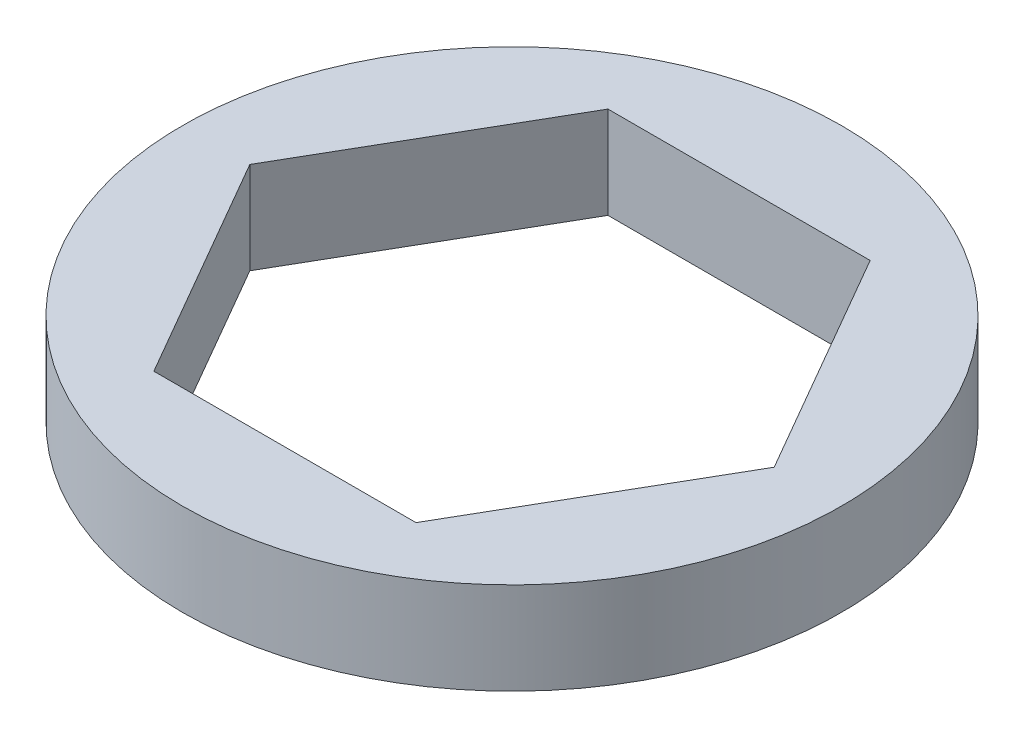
ISO-10303-21;
HEADER;
FILE_DESCRIPTION(('STEP AP214'),'2;1');
FILE_NAME('part.step','',(''),(''),'','','');
FILE_SCHEMA(('AUTOMOTIVE_DESIGN { 1 0 10303 214 1 1 1 1 }'));
ENDSEC;
DATA;
#1=APPLICATION_CONTEXT('core data for automotive mechanical design processes');
#2=APPLICATION_PROTOCOL_DEFINITION('international standard','automotive_design',2000,#1);
#3=PRODUCT_CONTEXT('',#1,'mechanical');
#4=PRODUCT('Part','Part','',(#3));
#5=PRODUCT_RELATED_PRODUCT_CATEGORY('part','',(#4));
#6=PRODUCT_DEFINITION_FORMATION('','',#4);
#7=PRODUCT_DEFINITION_CONTEXT('part definition',#1,'design');
#8=PRODUCT_DEFINITION('design','',#6,#7);
#9=PRODUCT_DEFINITION_SHAPE('','',#8);
#10=(LENGTH_UNIT() NAMED_UNIT(*) SI_UNIT(.MILLI.,.METRE.));
#11=(NAMED_UNIT(*) PLANE_ANGLE_UNIT() SI_UNIT($,.RADIAN.));
#12=(NAMED_UNIT(*) SI_UNIT($,.STERADIAN.) SOLID_ANGLE_UNIT());
#13=UNCERTAINTY_MEASURE_WITH_UNIT(LENGTH_MEASURE(1.E-05),#10,'distance_accuracy_value','');
#14=(GEOMETRIC_REPRESENTATION_CONTEXT(3) GLOBAL_UNCERTAINTY_ASSIGNED_CONTEXT((#13)) GLOBAL_UNIT_ASSIGNED_CONTEXT((#10,
#11,#12)) REPRESENTATION_CONTEXT('',''));
#15=CARTESIAN_POINT('',(0.,0.,0.));
#16=DIRECTION('',(0.,0.,1.));
#17=DIRECTION('',(1.,0.,0.));
#18=AXIS2_PLACEMENT_3D('',#15,#16,#17);
#19=CARTESIAN_POINT('',(0.,1.419479,0.));
#20=DIRECTION('',(0.,1.,0.));
#21=DIRECTION('',(0.,0.,1.));
#22=AXIS2_PLACEMENT_3D('',#19,#20,#21);
#23=PLANE('',#22);
#24=CARTESIAN_POINT('',(0.,1.419479,0.));
#25=DIRECTION('',(0.,1.,0.));
#26=DIRECTION('',(0.,0.,1.));
#27=AXIS2_PLACEMENT_3D('',#24,#25,#26);
#28=CIRCLE('',#27,5.08);
#29=CARTESIAN_POINT('',(0.,1.419479,5.08));
#30=VERTEX_POINT('',#29);
#31=EDGE_CURVE('E11',#30,#30,#28,.T.);
#32=ORIENTED_EDGE('',*,*,#31,.T.);
#33=EDGE_LOOP('',(#32));
#34=FACE_BOUND('',#33,.T.);
#35=DIRECTION('',(-1.,0.,0.));
#36=VECTOR('',#35,1.);
#37=CARTESIAN_POINT('',(2.02072594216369,1.419479,-3.5));
#38=LINE('',#37,#36);
#39=CARTESIAN_POINT('',(2.02072594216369,1.419479,-3.5));
#40=VERTEX_POINT('',#39);
#41=CARTESIAN_POINT('',(-2.02072594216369,1.419479,-3.5));
#42=VERTEX_POINT('',#41);
#43=EDGE_CURVE('E98',#40,#42,#38,.T.);
#44=ORIENTED_EDGE('',*,*,#43,.F.);
#45=DIRECTION('',(-0.5,0.,-0.866025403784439));
#46=VECTOR('',#45,1.);
#47=CARTESIAN_POINT('',(4.04145188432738,1.419479,0.));
#48=LINE('',#47,#46);
#49=CARTESIAN_POINT('',(4.04145188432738,1.419479,0.));
#50=VERTEX_POINT('',#49);
#51=EDGE_CURVE('E90',#50,#40,#48,.T.);
#52=ORIENTED_EDGE('',*,*,#51,.F.);
#53=DIRECTION('',(0.5,0.,-0.866025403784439));
#54=VECTOR('',#53,1.);
#55=CARTESIAN_POINT('',(2.02072594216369,1.419479,3.5));
#56=LINE('',#55,#54);
#57=CARTESIAN_POINT('',(2.02072594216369,1.419479,3.5));
#58=VERTEX_POINT('',#57);
#59=EDGE_CURVE('E118',#58,#50,#56,.T.);
#60=ORIENTED_EDGE('',*,*,#59,.F.);
#61=DIRECTION('',(1.,0.,0.));
#62=VECTOR('',#61,1.);
#63=CARTESIAN_POINT('',(-2.02072594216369,1.419479,3.5));
#64=LINE('',#63,#62);
#65=CARTESIAN_POINT('',(-2.02072594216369,1.419479,3.5));
#66=VERTEX_POINT('',#65);
#67=EDGE_CURVE('E116',#66,#58,#64,.T.);
#68=ORIENTED_EDGE('',*,*,#67,.F.);
#69=DIRECTION('',(0.5,0.,0.866025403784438));
#70=VECTOR('',#69,1.);
#71=CARTESIAN_POINT('',(-4.04145188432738,1.419479,0.));
#72=LINE('',#71,#70);
#73=CARTESIAN_POINT('',(-4.04145188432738,1.419479,0.));
#74=VERTEX_POINT('',#73);
#75=EDGE_CURVE('E112',#74,#66,#72,.T.);
#76=ORIENTED_EDGE('',*,*,#75,.F.);
#77=DIRECTION('',(-0.499999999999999,0.,0.866025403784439));
#78=VECTOR('',#77,1.);
#79=CARTESIAN_POINT('',(-2.02072594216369,1.419479,-3.5));
#80=LINE('',#79,#78);
#81=EDGE_CURVE('E110',#42,#74,#80,.T.);
#82=ORIENTED_EDGE('',*,*,#81,.F.);
#83=EDGE_LOOP('',(#44,#52,#60,#68,#76,#82));
#84=FACE_BOUND('',#83,.T.);
#85=ADVANCED_FACE('F37',(#34,#84),#23,.T.);
#86=CARTESIAN_POINT('',(0.,0.,0.));
#87=DIRECTION('',(0.,1.,0.));
#88=DIRECTION('',(0.,0.,1.));
#89=AXIS2_PLACEMENT_3D('',#86,#87,#88);
#90=PLANE('',#89);
#91=CARTESIAN_POINT('',(0.,0.,0.));
#92=DIRECTION('',(0.,1.,0.));
#93=DIRECTION('',(0.,0.,1.));
#94=AXIS2_PLACEMENT_3D('',#91,#92,#93);
#95=CIRCLE('',#94,5.08);
#96=CARTESIAN_POINT('',(0.,0.,5.08));
#97=VERTEX_POINT('',#96);
#98=EDGE_CURVE('E41',#97,#97,#95,.T.);
#99=ORIENTED_EDGE('',*,*,#98,.F.);
#100=EDGE_LOOP('',(#99));
#101=FACE_BOUND('',#100,.T.);
#102=DIRECTION('',(-0.5,0.,-0.866025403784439));
#103=VECTOR('',#102,1.);
#104=CARTESIAN_POINT('',(4.04145188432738,0.,0.));
#105=LINE('',#104,#103);
#106=CARTESIAN_POINT('',(4.04145188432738,0.,0.));
#107=VERTEX_POINT('',#106);
#108=CARTESIAN_POINT('',(2.02072594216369,0.,-3.5));
#109=VERTEX_POINT('',#108);
#110=EDGE_CURVE('E60',#107,#109,#105,.T.);
#111=ORIENTED_EDGE('',*,*,#110,.T.);
#112=DIRECTION('',(-1.,0.,0.));
#113=VECTOR('',#112,1.);
#114=CARTESIAN_POINT('',(2.02072594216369,0.,-3.5));
#115=LINE('',#114,#113);
#116=CARTESIAN_POINT('',(-2.02072594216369,0.,-3.5));
#117=VERTEX_POINT('',#116);
#118=EDGE_CURVE('E105',#109,#117,#115,.T.);
#119=ORIENTED_EDGE('',*,*,#118,.T.);
#120=DIRECTION('',(-0.499999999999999,0.,0.866025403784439));
#121=VECTOR('',#120,1.);
#122=CARTESIAN_POINT('',(-2.02072594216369,0.,-3.5));
#123=LINE('',#122,#121);
#124=CARTESIAN_POINT('',(-4.04145188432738,0.,0.));
#125=VERTEX_POINT('',#124);
#126=EDGE_CURVE('E122',#117,#125,#123,.T.);
#127=ORIENTED_EDGE('',*,*,#126,.T.);
#128=DIRECTION('',(0.5,0.,0.866025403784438));
#129=VECTOR('',#128,1.);
#130=CARTESIAN_POINT('',(-4.04145188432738,0.,0.));
#131=LINE('',#130,#129);
#132=CARTESIAN_POINT('',(-2.02072594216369,0.,3.5));
#133=VERTEX_POINT('',#132);
#134=EDGE_CURVE('E125',#125,#133,#131,.T.);
#135=ORIENTED_EDGE('',*,*,#134,.T.);
#136=DIRECTION('',(1.,0.,0.));
#137=VECTOR('',#136,1.);
#138=CARTESIAN_POINT('',(-2.02072594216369,0.,3.5));
#139=LINE('',#138,#137);
#140=CARTESIAN_POINT('',(2.02072594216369,0.,3.5));
#141=VERTEX_POINT('',#140);
#142=EDGE_CURVE('E128',#133,#141,#139,.T.);
#143=ORIENTED_EDGE('',*,*,#142,.T.);
#144=DIRECTION('',(0.5,0.,-0.866025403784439));
#145=VECTOR('',#144,1.);
#146=CARTESIAN_POINT('',(2.02072594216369,0.,3.5));
#147=LINE('',#146,#145);
#148=EDGE_CURVE('E99',#141,#107,#147,.T.);
#149=ORIENTED_EDGE('',*,*,#148,.T.);
#150=EDGE_LOOP('',(#111,#119,#127,#135,#143,#149));
#151=FACE_BOUND('',#150,.T.);
#152=ADVANCED_FACE('F145',(#101,#151),#90,.F.);
#153=CARTESIAN_POINT('',(0.,1.419479,0.));
#154=DIRECTION('',(0.,-1.,0.));
#155=DIRECTION('',(0.,0.,-1.));
#156=AXIS2_PLACEMENT_3D('',#153,#154,#155);
#157=CYLINDRICAL_SURFACE('',#156,5.08);
#158=ORIENTED_EDGE('',*,*,#31,.F.);
#159=EDGE_LOOP('',(#158));
#160=FACE_BOUND('',#159,.T.);
#161=ORIENTED_EDGE('',*,*,#98,.T.);
#162=EDGE_LOOP('',(#161));
#163=FACE_BOUND('',#162,.T.);
#164=ADVANCED_FACE('F39',(#160,#163),#157,.T.);
#165=CARTESIAN_POINT('',(4.04145188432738,1.419479,0.));
#166=DIRECTION('',(-0.866025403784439,0.,0.5));
#167=DIRECTION('',(0.5,0.,0.866025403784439));
#168=AXIS2_PLACEMENT_3D('',#165,#166,#167);
#169=PLANE('',#168);
#170=ORIENTED_EDGE('',*,*,#110,.F.);
#171=DIRECTION('',(0.,-1.,0.));
#172=VECTOR('',#171,1.);
#173=CARTESIAN_POINT('',(4.04145188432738,1.419479,0.));
#174=LINE('',#173,#172);
#175=EDGE_CURVE('E94',#50,#107,#174,.T.);
#176=ORIENTED_EDGE('',*,*,#175,.F.);
#177=ORIENTED_EDGE('',*,*,#51,.T.);
#178=DIRECTION('',(0.,-1.,0.));
#179=VECTOR('',#178,1.);
#180=CARTESIAN_POINT('',(2.02072594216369,1.419479,-3.5));
#181=LINE('',#180,#179);
#182=EDGE_CURVE('E93',#40,#109,#181,.T.);
#183=ORIENTED_EDGE('',*,*,#182,.T.);
#184=EDGE_LOOP('',(#170,#176,#177,#183));
#185=FACE_BOUND('',#184,.T.);
#186=ADVANCED_FACE('F92',(#185),#169,.T.);
#187=CARTESIAN_POINT('',(2.02072594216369,1.419479,-3.5));
#188=DIRECTION('',(0.,0.,1.));
#189=DIRECTION('',(1.,0.,0.));
#190=AXIS2_PLACEMENT_3D('',#187,#188,#189);
#191=PLANE('',#190);
#192=ORIENTED_EDGE('',*,*,#118,.F.);
#193=ORIENTED_EDGE('',*,*,#182,.F.);
#194=ORIENTED_EDGE('',*,*,#43,.T.);
#195=DIRECTION('',(0.,-1.,0.));
#196=VECTOR('',#195,1.);
#197=CARTESIAN_POINT('',(-2.02072594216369,1.419479,-3.5));
#198=LINE('',#197,#196);
#199=EDGE_CURVE('E106',#42,#117,#198,.T.);
#200=ORIENTED_EDGE('',*,*,#199,.T.);
#201=EDGE_LOOP('',(#192,#193,#194,#200));
#202=FACE_BOUND('',#201,.T.);
#203=ADVANCED_FACE('F102',(#202),#191,.T.);
#204=CARTESIAN_POINT('',(-2.02072594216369,1.419479,-3.5));
#205=DIRECTION('',(0.866025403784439,0.,0.5));
#206=DIRECTION('',(0.5,0.,-0.866025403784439));
#207=AXIS2_PLACEMENT_3D('',#204,#205,#206);
#208=PLANE('',#207);
#209=ORIENTED_EDGE('',*,*,#126,.F.);
#210=ORIENTED_EDGE('',*,*,#199,.F.);
#211=ORIENTED_EDGE('',*,*,#81,.T.);
#212=DIRECTION('',(0.,-1.,0.));
#213=VECTOR('',#212,1.);
#214=CARTESIAN_POINT('',(-4.04145188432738,1.419479,0.));
#215=LINE('',#214,#213);
#216=EDGE_CURVE('E137',#74,#125,#215,.T.);
#217=ORIENTED_EDGE('',*,*,#216,.T.);
#218=EDGE_LOOP('',(#209,#210,#211,#217));
#219=FACE_BOUND('',#218,.T.);
#220=ADVANCED_FACE('F141',(#219),#208,.T.);
#221=CARTESIAN_POINT('',(-4.04145188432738,1.419479,0.));
#222=DIRECTION('',(0.866025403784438,0.,-0.5));
#223=DIRECTION('',(-0.5,0.,-0.866025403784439));
#224=AXIS2_PLACEMENT_3D('',#221,#222,#223);
#225=PLANE('',#224);
#226=ORIENTED_EDGE('',*,*,#134,.F.);
#227=ORIENTED_EDGE('',*,*,#216,.F.);
#228=ORIENTED_EDGE('',*,*,#75,.T.);
#229=DIRECTION('',(0.,-1.,0.));
#230=VECTOR('',#229,1.);
#231=CARTESIAN_POINT('',(-2.02072594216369,1.419479,3.5));
#232=LINE('',#231,#230);
#233=EDGE_CURVE('E135',#66,#133,#232,.T.);
#234=ORIENTED_EDGE('',*,*,#233,.T.);
#235=EDGE_LOOP('',(#226,#227,#228,#234));
#236=FACE_BOUND('',#235,.T.);
#237=ADVANCED_FACE('F153',(#236),#225,.T.);
#238=CARTESIAN_POINT('',(-2.02072594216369,1.419479,3.5));
#239=DIRECTION('',(0.,0.,-1.));
#240=DIRECTION('',(-1.,0.,0.));
#241=AXIS2_PLACEMENT_3D('',#238,#239,#240);
#242=PLANE('',#241);
#243=ORIENTED_EDGE('',*,*,#142,.F.);
#244=ORIENTED_EDGE('',*,*,#233,.F.);
#245=ORIENTED_EDGE('',*,*,#67,.T.);
#246=DIRECTION('',(0.,-1.,0.));
#247=VECTOR('',#246,1.);
#248=CARTESIAN_POINT('',(2.02072594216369,1.419479,3.5));
#249=LINE('',#248,#247);
#250=EDGE_CURVE('E52',#58,#141,#249,.T.);
#251=ORIENTED_EDGE('',*,*,#250,.T.);
#252=EDGE_LOOP('',(#243,#244,#245,#251));
#253=FACE_BOUND('',#252,.T.);
#254=ADVANCED_FACE('F151',(#253),#242,.T.);
#255=CARTESIAN_POINT('',(2.02072594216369,1.419479,3.5));
#256=DIRECTION('',(-0.866025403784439,0.,-0.5));
#257=DIRECTION('',(-0.5,0.,0.866025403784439));
#258=AXIS2_PLACEMENT_3D('',#255,#256,#257);
#259=PLANE('',#258);
#260=ORIENTED_EDGE('',*,*,#148,.F.);
#261=ORIENTED_EDGE('',*,*,#250,.F.);
#262=ORIENTED_EDGE('',*,*,#59,.T.);
#263=ORIENTED_EDGE('',*,*,#175,.T.);
#264=EDGE_LOOP('',(#260,#261,#262,#263));
#265=FACE_BOUND('',#264,.T.);
#266=ADVANCED_FACE('F147',(#265),#259,.T.);
#267=CLOSED_SHELL('',(#85,#152,#164,#186,#203,#220,#237,#254,#266));
#268=MANIFOLD_SOLID_BREP('B2',#267);
#269=ADVANCED_BREP_SHAPE_REPRESENTATION('',(#18,#268),#14);
#270=SHAPE_DEFINITION_REPRESENTATION(#9,#269);
ENDSEC;
END-ISO-10303-21;
